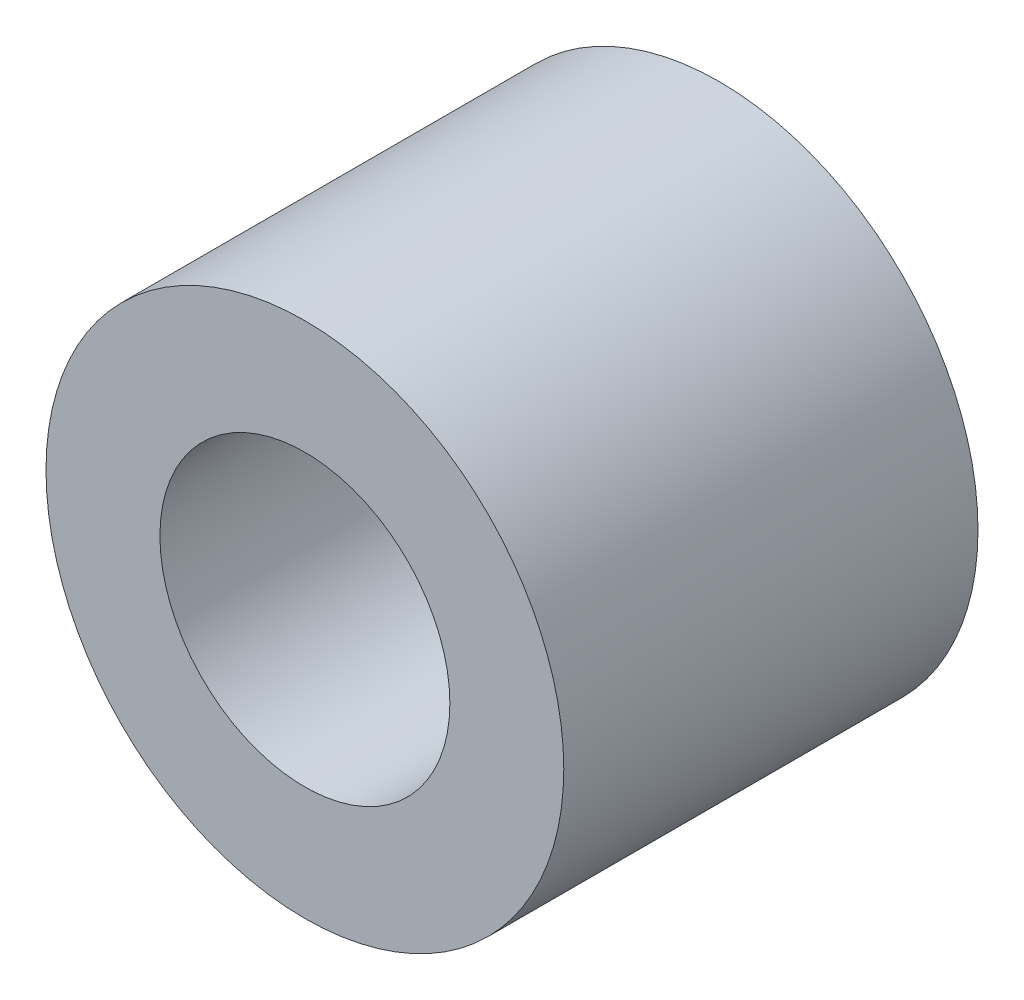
ISO-10303-21;
HEADER;
FILE_DESCRIPTION(('STEP AP214'),'2;1');
FILE_NAME('part.step','',(''),(''),'','','');
FILE_SCHEMA(('AUTOMOTIVE_DESIGN { 1 0 10303 214 1 1 1 1 }'));
ENDSEC;
DATA;
#1=APPLICATION_CONTEXT('core data for automotive mechanical design processes');
#2=APPLICATION_PROTOCOL_DEFINITION('international standard','automotive_design',2000,#1);
#3=PRODUCT_CONTEXT('',#1,'mechanical');
#4=PRODUCT('Part','Part','',(#3));
#5=PRODUCT_RELATED_PRODUCT_CATEGORY('part','',(#4));
#6=PRODUCT_DEFINITION_FORMATION('','',#4);
#7=PRODUCT_DEFINITION_CONTEXT('part definition',#1,'design');
#8=PRODUCT_DEFINITION('design','',#6,#7);
#9=PRODUCT_DEFINITION_SHAPE('','',#8);
#10=(LENGTH_UNIT() NAMED_UNIT(*) SI_UNIT(.MILLI.,.METRE.));
#11=(NAMED_UNIT(*) PLANE_ANGLE_UNIT() SI_UNIT($,.RADIAN.));
#12=(NAMED_UNIT(*) SI_UNIT($,.STERADIAN.) SOLID_ANGLE_UNIT());
#13=UNCERTAINTY_MEASURE_WITH_UNIT(LENGTH_MEASURE(1.E-05),#10,'distance_accuracy_value','');
#14=(GEOMETRIC_REPRESENTATION_CONTEXT(3) GLOBAL_UNCERTAINTY_ASSIGNED_CONTEXT((#13)) GLOBAL_UNIT_ASSIGNED_CONTEXT((#10,
#11,#12)) REPRESENTATION_CONTEXT('',''));
#15=CARTESIAN_POINT('',(0.,0.,0.));
#16=DIRECTION('',(0.,0.,1.));
#17=DIRECTION('',(1.,0.,0.));
#18=AXIS2_PLACEMENT_3D('',#15,#16,#17);
#19=CARTESIAN_POINT('',(7.,0.,7.));
#20=DIRECTION('',(0.,0.,-1.));
#21=DIRECTION('',(-1.,0.,0.));
#22=AXIS2_PLACEMENT_3D('',#19,#20,#21);
#23=PLANE('',#22);
#24=CARTESIAN_POINT('',(0.,0.,7.));
#25=DIRECTION('',(0.,0.,1.));
#26=DIRECTION('',(1.,0.,0.));
#27=AXIS2_PLACEMENT_3D('',#24,#25,#26);
#28=CIRCLE('',#27,4.5);
#29=CARTESIAN_POINT('',(4.5,0.,7.));
#30=VERTEX_POINT('',#29);
#31=EDGE_CURVE('E8',#30,#30,#28,.T.);
#32=ORIENTED_EDGE('',*,*,#31,.F.);
#33=EDGE_LOOP('',(#32));
#34=FACE_BOUND('',#33,.T.);
#35=CARTESIAN_POINT('',(0.,0.,7.));
#36=DIRECTION('',(0.,0.,1.));
#37=DIRECTION('',(1.,0.,0.));
#38=AXIS2_PLACEMENT_3D('',#35,#36,#37);
#39=CIRCLE('',#38,7.);
#40=CARTESIAN_POINT('',(7.,0.,7.));
#41=VERTEX_POINT('',#40);
#42=EDGE_CURVE('E34',#41,#41,#39,.T.);
#43=ORIENTED_EDGE('',*,*,#42,.T.);
#44=EDGE_LOOP('',(#43));
#45=FACE_BOUND('',#44,.T.);
#46=ADVANCED_FACE('F12',(#34,#45),#23,.F.);
#47=CARTESIAN_POINT('',(0.,0.,40.));
#48=DIRECTION('',(0.,0.,1.));
#49=DIRECTION('',(1.,0.,0.));
#50=AXIS2_PLACEMENT_3D('',#47,#48,#49);
#51=CYLINDRICAL_SURFACE('',#50,4.5);
#52=CARTESIAN_POINT('',(0.,0.,0.));
#53=DIRECTION('',(0.,0.,1.));
#54=DIRECTION('',(1.,0.,0.));
#55=AXIS2_PLACEMENT_3D('',#52,#53,#54);
#56=CIRCLE('',#55,4.5);
#57=CARTESIAN_POINT('',(4.5,0.,0.));
#58=VERTEX_POINT('',#57);
#59=EDGE_CURVE('E18',#58,#58,#56,.T.);
#60=ORIENTED_EDGE('',*,*,#59,.F.);
#61=EDGE_LOOP('',(#60));
#62=FACE_BOUND('',#61,.T.);
#63=ORIENTED_EDGE('',*,*,#31,.T.);
#64=EDGE_LOOP('',(#63));
#65=FACE_BOUND('',#64,.T.);
#66=ADVANCED_FACE('F59',(#62,#65),#51,.F.);
#67=CARTESIAN_POINT('',(4.5,0.,0.));
#68=DIRECTION('',(0.,0.,1.));
#69=DIRECTION('',(1.,0.,0.));
#70=AXIS2_PLACEMENT_3D('',#67,#68,#69);
#71=PLANE('',#70);
#72=CARTESIAN_POINT('',(0.,0.,0.));
#73=DIRECTION('',(0.,0.,1.));
#74=DIRECTION('',(1.,0.,0.));
#75=AXIS2_PLACEMENT_3D('',#72,#73,#74);
#76=CIRCLE('',#75,12.5);
#77=CARTESIAN_POINT('',(12.5,0.,0.));
#78=VERTEX_POINT('',#77);
#79=EDGE_CURVE('E22',#78,#78,#76,.T.);
#80=ORIENTED_EDGE('',*,*,#79,.F.);
#81=EDGE_LOOP('',(#80));
#82=FACE_BOUND('',#81,.T.);
#83=ORIENTED_EDGE('',*,*,#59,.T.);
#84=EDGE_LOOP('',(#83));
#85=FACE_BOUND('',#84,.T.);
#86=ADVANCED_FACE('F54',(#82,#85),#71,.F.);
#87=CARTESIAN_POINT('',(0.,0.,40.));
#88=DIRECTION('',(0.,0.,1.));
#89=DIRECTION('',(1.,0.,0.));
#90=AXIS2_PLACEMENT_3D('',#87,#88,#89);
#91=CYLINDRICAL_SURFACE('',#90,12.5);
#92=CARTESIAN_POINT('',(0.,0.,20.));
#93=DIRECTION('',(0.,0.,1.));
#94=DIRECTION('',(1.,0.,0.));
#95=AXIS2_PLACEMENT_3D('',#92,#93,#94);
#96=CIRCLE('',#95,12.5);
#97=CARTESIAN_POINT('',(12.5,0.,20.));
#98=VERTEX_POINT('',#97);
#99=EDGE_CURVE('E26',#98,#98,#96,.T.);
#100=ORIENTED_EDGE('',*,*,#99,.F.);
#101=EDGE_LOOP('',(#100));
#102=FACE_BOUND('',#101,.T.);
#103=ORIENTED_EDGE('',*,*,#79,.T.);
#104=EDGE_LOOP('',(#103));
#105=FACE_BOUND('',#104,.T.);
#106=ADVANCED_FACE('F48',(#102,#105),#91,.T.);
#107=CARTESIAN_POINT('',(12.5,0.,20.));
#108=DIRECTION('',(0.,0.,-1.));
#109=DIRECTION('',(-1.,0.,0.));
#110=AXIS2_PLACEMENT_3D('',#107,#108,#109);
#111=PLANE('',#110);
#112=CARTESIAN_POINT('',(0.,0.,20.));
#113=DIRECTION('',(0.,0.,1.));
#114=DIRECTION('',(1.,0.,0.));
#115=AXIS2_PLACEMENT_3D('',#112,#113,#114);
#116=CIRCLE('',#115,7.);
#117=CARTESIAN_POINT('',(7.,0.,20.));
#118=VERTEX_POINT('',#117);
#119=EDGE_CURVE('E31',#118,#118,#116,.T.);
#120=ORIENTED_EDGE('',*,*,#119,.F.);
#121=EDGE_LOOP('',(#120));
#122=FACE_BOUND('',#121,.T.);
#123=ORIENTED_EDGE('',*,*,#99,.T.);
#124=EDGE_LOOP('',(#123));
#125=FACE_BOUND('',#124,.T.);
#126=ADVANCED_FACE('F42',(#122,#125),#111,.F.);
#127=CARTESIAN_POINT('',(0.,0.,40.));
#128=DIRECTION('',(0.,0.,1.));
#129=DIRECTION('',(1.,0.,0.));
#130=AXIS2_PLACEMENT_3D('',#127,#128,#129);
#131=CYLINDRICAL_SURFACE('',#130,7.);
#132=ORIENTED_EDGE('',*,*,#42,.F.);
#133=EDGE_LOOP('',(#132));
#134=FACE_BOUND('',#133,.T.);
#135=ORIENTED_EDGE('',*,*,#119,.T.);
#136=EDGE_LOOP('',(#135));
#137=FACE_BOUND('',#136,.T.);
#138=ADVANCED_FACE('F39',(#134,#137),#131,.F.);
#139=CLOSED_SHELL('',(#46,#66,#86,#106,#126,#138));
#140=MANIFOLD_SOLID_BREP('B1',#139);
#141=ADVANCED_BREP_SHAPE_REPRESENTATION('',(#18,#140),#14);
#142=SHAPE_DEFINITION_REPRESENTATION(#9,#141);
ENDSEC;
END-ISO-10303-21;
